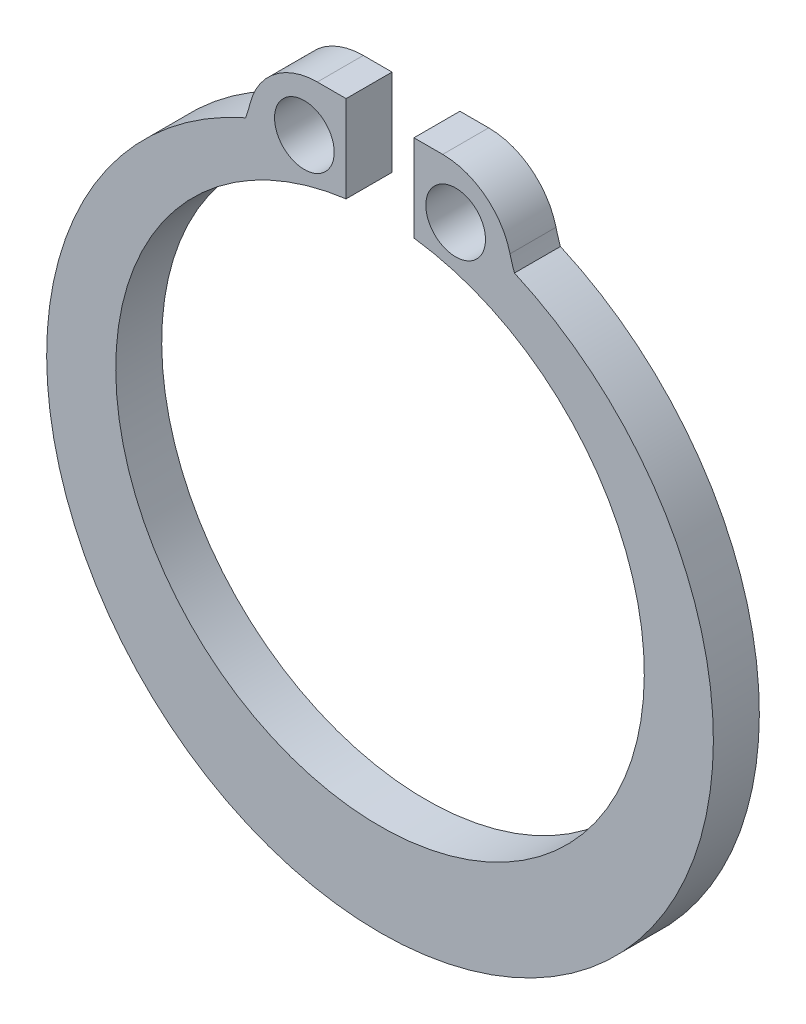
from build123d import *

# Parameters (mm, degrees)
ESQUISSE1_R          = 0.649210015
BASE_EXTRUSION_DEPTH = 1


with BuildPart() as part:
    # Esquisse1 → Base-Extrusion (new body)
    with BuildSketch(Plane.XY):
        with BuildLine():
            Line((-0.73799165, 8.092168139), (-0.73799165, 6.202444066))
            ThreePointArc((-0.73799165, 6.202444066), (0, -5.25), (0.73799165, 6.202444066))
            Line((0.73799165, 6.202444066), (0.73799165, 8.092168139))
            Line((0.73799165, 8.092168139), (1.363993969, 8.092168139))
            ThreePointArc((1.363993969, 8.092168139), (2.292326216, 7.773238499), (2.828651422, 6.95112406))
            ThreePointArc((2.828651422, 6.95112406), (2.872870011, 6.792832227), (2.925032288, 6.636977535))
            ThreePointArc((2.925032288, 6.636977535), (0, -7.252950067), (-2.925032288, 6.636977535))
            ThreePointArc((-2.925032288, 6.636977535), (-2.872870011, 6.792832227), (-2.828651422, 6.95112406))
            ThreePointArc((-2.828651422, 6.95112406), (-2.292326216, 7.773238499), (-1.363993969, 8.092168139))
            Line((-1.363993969, 8.092168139), (-0.73799165, 8.092168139))
        make_face()
        with Locations((-1.646072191, 6.95112406)):
            Circle(ESQUISSE1_R, mode=Mode.SUBTRACT)
        with Locations(Location((1.646072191, 6.95112406, 0), (0, 0, 180))):
            Circle(ESQUISSE1_R, mode=Mode.SUBTRACT)
    extrude(amount=BASE_EXTRUSION_DEPTH)


solid = part.part
